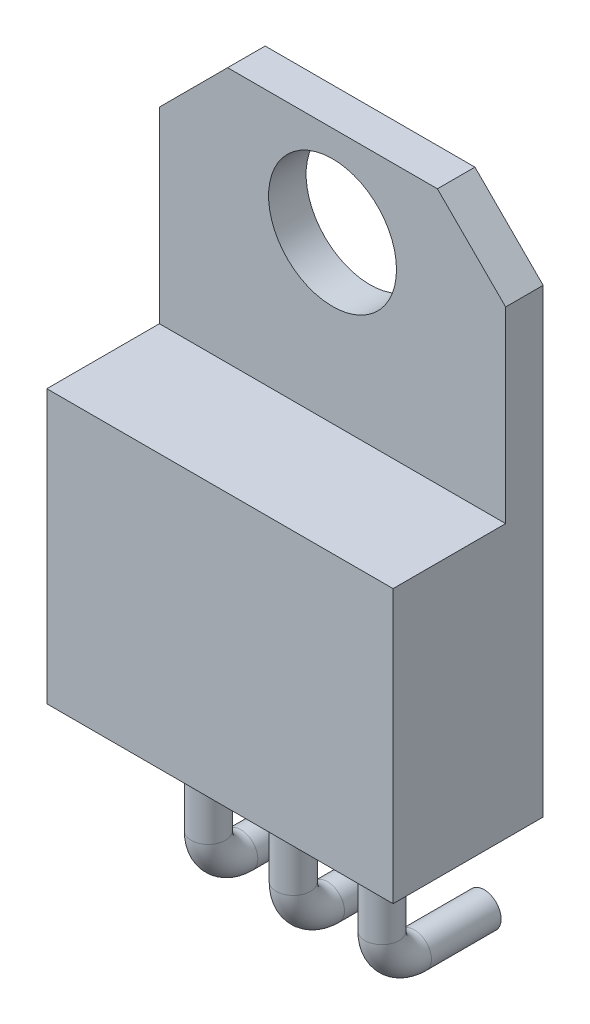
ISO-10303-21;
HEADER;
FILE_DESCRIPTION(('STEP AP214'),'2;1');
FILE_NAME('part.step','',(''),(''),'','','');
FILE_SCHEMA(('AUTOMOTIVE_DESIGN { 1 0 10303 214 1 1 1 1 }'));
ENDSEC;
DATA;
#1=APPLICATION_CONTEXT('core data for automotive mechanical design processes');
#2=APPLICATION_PROTOCOL_DEFINITION('international standard','automotive_design',2000,#1);
#3=PRODUCT_CONTEXT('',#1,'mechanical');
#4=PRODUCT('Part','Part','',(#3));
#5=PRODUCT_RELATED_PRODUCT_CATEGORY('part','',(#4));
#6=PRODUCT_DEFINITION_FORMATION('','',#4);
#7=PRODUCT_DEFINITION_CONTEXT('part definition',#1,'design');
#8=PRODUCT_DEFINITION('design','',#6,#7);
#9=PRODUCT_DEFINITION_SHAPE('','',#8);
#10=(LENGTH_UNIT() NAMED_UNIT(*) SI_UNIT(.MILLI.,.METRE.));
#11=(NAMED_UNIT(*) PLANE_ANGLE_UNIT() SI_UNIT($,.RADIAN.));
#12=(NAMED_UNIT(*) SI_UNIT($,.STERADIAN.) SOLID_ANGLE_UNIT());
#13=UNCERTAINTY_MEASURE_WITH_UNIT(LENGTH_MEASURE(1.E-05),#10,'distance_accuracy_value','');
#14=(GEOMETRIC_REPRESENTATION_CONTEXT(3) GLOBAL_UNCERTAINTY_ASSIGNED_CONTEXT((#13)) GLOBAL_UNIT_ASSIGNED_CONTEXT((#10,
#11,#12)) REPRESENTATION_CONTEXT('',''));
#15=CARTESIAN_POINT('',(0.,0.,0.));
#16=DIRECTION('',(0.,0.,1.));
#17=DIRECTION('',(1.,0.,0.));
#18=AXIS2_PLACEMENT_3D('',#15,#16,#17);
#19=CARTESIAN_POINT('',(0.,0.,1.1));
#20=DIRECTION('',(0.,1.,0.));
#21=DIRECTION('',(0.,0.,1.));
#22=AXIS2_PLACEMENT_3D('',#19,#20,#21);
#23=PLANE('',#22);
#24=CARTESIAN_POINT('',(7.625,0.,2.2));
#25=DIRECTION('',(0.,1.,0.));
#26=DIRECTION('',(0.,0.,-1.));
#27=AXIS2_PLACEMENT_3D('',#24,#25,#26);
#28=CIRCLE('',#27,0.5);
#29=CARTESIAN_POINT('',(7.625,0.,1.7));
#30=VERTEX_POINT('',#29);
#31=EDGE_CURVE('E466',#30,#30,#28,.T.);
#32=ORIENTED_EDGE('',*,*,#31,.T.);
#33=EDGE_LOOP('',(#32));
#34=FACE_BOUND('',#33,.T.);
#35=CARTESIAN_POINT('',(2.535,0.,2.2));
#36=DIRECTION('',(0.,1.,0.));
#37=DIRECTION('',(0.,0.,1.));
#38=AXIS2_PLACEMENT_3D('',#35,#36,#37);
#39=CIRCLE('',#38,0.5);
#40=CARTESIAN_POINT('',(2.535,0.,2.7));
#41=VERTEX_POINT('',#40);
#42=EDGE_CURVE('E36',#41,#41,#39,.F.);
#43=ORIENTED_EDGE('',*,*,#42,.F.);
#44=EDGE_LOOP('',(#43));
#45=FACE_BOUND('',#44,.T.);
#46=DIRECTION('',(1.,0.,0.));
#47=VECTOR('',#46,1.);
#48=CARTESIAN_POINT('',(0.,0.,0.));
#49=LINE('',#48,#47);
#50=CARTESIAN_POINT('',(0.,0.,0.));
#51=VERTEX_POINT('',#50);
#52=CARTESIAN_POINT('',(10.15,0.,0.));
#53=VERTEX_POINT('',#52);
#54=EDGE_CURVE('E186',#51,#53,#49,.T.);
#55=ORIENTED_EDGE('',*,*,#54,.T.);
#56=DIRECTION('',(0.,0.,-1.));
#57=VECTOR('',#56,1.);
#58=CARTESIAN_POINT('',(10.15,0.,1.1));
#59=LINE('',#58,#57);
#60=CARTESIAN_POINT('',(10.15,0.,4.4));
#61=VERTEX_POINT('',#60);
#62=EDGE_CURVE('E110',#61,#53,#59,.T.);
#63=ORIENTED_EDGE('',*,*,#62,.F.);
#64=DIRECTION('',(1.,0.,0.));
#65=VECTOR('',#64,1.);
#66=CARTESIAN_POINT('',(0.,0.,4.4));
#67=LINE('',#66,#65);
#68=CARTESIAN_POINT('',(0.,0.,4.4));
#69=VERTEX_POINT('',#68);
#70=EDGE_CURVE('E113',#69,#61,#67,.T.);
#71=ORIENTED_EDGE('',*,*,#70,.F.);
#72=DIRECTION('',(0.,0.,-1.));
#73=VECTOR('',#72,1.);
#74=CARTESIAN_POINT('',(0.,0.,1.1));
#75=LINE('',#74,#73);
#76=EDGE_CURVE('E98',#69,#51,#75,.T.);
#77=ORIENTED_EDGE('',*,*,#76,.T.);
#78=EDGE_LOOP('',(#55,#63,#71,#77));
#79=FACE_BOUND('',#78,.T.);
#80=CARTESIAN_POINT('',(5.07499999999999,0.,2.25));
#81=DIRECTION('',(0.,-1.,0.));
#82=DIRECTION('',(0.,0.,-1.));
#83=AXIS2_PLACEMENT_3D('',#80,#81,#82);
#84=CIRCLE('',#83,0.500000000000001);
#85=CARTESIAN_POINT('',(5.07499999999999,0.,1.75));
#86=VERTEX_POINT('',#85);
#87=EDGE_CURVE('E11',#86,#86,#84,.T.);
#88=ORIENTED_EDGE('',*,*,#87,.F.);
#89=EDGE_LOOP('',(#88));
#90=FACE_BOUND('',#89,.T.);
#91=ADVANCED_FACE('F32',(#34,#45,#79,#90),#23,.F.);
#92=CARTESIAN_POINT('',(0.,15.5,1.1));
#93=DIRECTION('',(0.,0.,-1.));
#94=DIRECTION('',(-1.,0.,0.));
#95=AXIS2_PLACEMENT_3D('',#92,#93,#94);
#96=PLANE('',#95);
#97=CARTESIAN_POINT('',(5.075,12.85,1.1));
#98=DIRECTION('',(0.,0.,1.));
#99=DIRECTION('',(1.,0.,0.));
#100=AXIS2_PLACEMENT_3D('',#97,#98,#99);
#101=CIRCLE('',#100,1.875);
#102=CARTESIAN_POINT('',(6.94999999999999,12.85,1.1));
#103=VERTEX_POINT('',#102);
#104=EDGE_CURVE('E147',#103,#103,#101,.T.);
#105=ORIENTED_EDGE('',*,*,#104,.F.);
#106=EDGE_LOOP('',(#105));
#107=FACE_BOUND('',#106,.T.);
#108=DIRECTION('',(-1.,0.,0.));
#109=VECTOR('',#108,1.);
#110=CARTESIAN_POINT('',(0.,8.,1.1));
#111=LINE('',#110,#109);
#112=CARTESIAN_POINT('',(10.15,8.,1.1));
#113=VERTEX_POINT('',#112);
#114=CARTESIAN_POINT('',(0.,8.,1.1));
#115=VERTEX_POINT('',#114);
#116=EDGE_CURVE('E48',#113,#115,#111,.T.);
#117=ORIENTED_EDGE('',*,*,#116,.F.);
#118=DIRECTION('',(0.,1.,0.));
#119=VECTOR('',#118,1.);
#120=CARTESIAN_POINT('',(10.15,0.,1.1));
#121=LINE('',#120,#119);
#122=CARTESIAN_POINT('',(10.15,13.5,1.1));
#123=VERTEX_POINT('',#122);
#124=EDGE_CURVE('E161',#113,#123,#121,.T.);
#125=ORIENTED_EDGE('',*,*,#124,.T.);
#126=DIRECTION('',(0.707106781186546,-0.707106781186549,0.));
#127=VECTOR('',#126,1.);
#128=CARTESIAN_POINT('',(8.15,15.5,1.1));
#129=LINE('',#128,#127);
#130=CARTESIAN_POINT('',(8.14999999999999,15.5,1.1));
#131=VERTEX_POINT('',#130);
#132=EDGE_CURVE('E165',#123,#131,#129,.F.);
#133=ORIENTED_EDGE('',*,*,#132,.T.);
#134=DIRECTION('',(-1.,0.,0.));
#135=VECTOR('',#134,1.);
#136=CARTESIAN_POINT('',(0.,15.5,1.1));
#137=LINE('',#136,#135);
#138=CARTESIAN_POINT('',(2.,15.5,1.1));
#139=VERTEX_POINT('',#138);
#140=EDGE_CURVE('E159',#131,#139,#137,.T.);
#141=ORIENTED_EDGE('',*,*,#140,.T.);
#142=DIRECTION('',(0.707106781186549,0.707106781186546,0.));
#143=VECTOR('',#142,1.);
#144=CARTESIAN_POINT('',(0.,13.5,1.1));
#145=LINE('',#144,#143);
#146=CARTESIAN_POINT('',(0.,13.5,1.1));
#147=VERTEX_POINT('',#146);
#148=EDGE_CURVE('E54',#139,#147,#145,.F.);
#149=ORIENTED_EDGE('',*,*,#148,.T.);
#150=DIRECTION('',(0.,-1.,0.));
#151=VECTOR('',#150,1.);
#152=CARTESIAN_POINT('',(0.,0.,1.1));
#153=LINE('',#152,#151);
#154=EDGE_CURVE('E139',#147,#115,#153,.T.);
#155=ORIENTED_EDGE('',*,*,#154,.T.);
#156=EDGE_LOOP('',(#117,#125,#133,#141,#149,#155));
#157=FACE_BOUND('',#156,.T.);
#158=ADVANCED_FACE('F202',(#107,#157),#96,.F.);
#159=CARTESIAN_POINT('',(0.,0.,1.1));
#160=DIRECTION('',(1.,0.,0.));
#161=DIRECTION('',(0.,1.,0.));
#162=AXIS2_PLACEMENT_3D('',#159,#160,#161);
#163=PLANE('',#162);
#164=ORIENTED_EDGE('',*,*,#154,.F.);
#165=DIRECTION('',(0.,0.,-1.));
#166=VECTOR('',#165,1.);
#167=CARTESIAN_POINT('',(0.,13.5,1.1));
#168=LINE('',#167,#166);
#169=CARTESIAN_POINT('',(0.,13.5,0.));
#170=VERTEX_POINT('',#169);
#171=EDGE_CURVE('E163',#147,#170,#168,.T.);
#172=ORIENTED_EDGE('',*,*,#171,.T.);
#173=DIRECTION('',(0.,-1.,0.));
#174=VECTOR('',#173,1.);
#175=CARTESIAN_POINT('',(0.,0.,0.));
#176=LINE('',#175,#174);
#177=EDGE_CURVE('E106',#170,#51,#176,.T.);
#178=ORIENTED_EDGE('',*,*,#177,.T.);
#179=ORIENTED_EDGE('',*,*,#76,.F.);
#180=DIRECTION('',(0.,-1.,0.));
#181=VECTOR('',#180,1.);
#182=CARTESIAN_POINT('',(0.,0.,4.4));
#183=LINE('',#182,#181);
#184=CARTESIAN_POINT('',(0.,8.,4.4));
#185=VERTEX_POINT('',#184);
#186=EDGE_CURVE('E103',#185,#69,#183,.T.);
#187=ORIENTED_EDGE('',*,*,#186,.F.);
#188=DIRECTION('',(0.,0.,-1.));
#189=VECTOR('',#188,1.);
#190=CARTESIAN_POINT('',(0.,8.,4.4));
#191=LINE('',#190,#189);
#192=EDGE_CURVE('E132',#185,#115,#191,.T.);
#193=ORIENTED_EDGE('',*,*,#192,.T.);
#194=EDGE_LOOP('',(#164,#172,#178,#179,#187,#193));
#195=FACE_BOUND('',#194,.T.);
#196=ADVANCED_FACE('F100',(#195),#163,.F.);
#197=CARTESIAN_POINT('',(10.15,0.,1.1));
#198=DIRECTION('',(-1.,0.,0.));
#199=DIRECTION('',(0.,-1.,0.));
#200=AXIS2_PLACEMENT_3D('',#197,#198,#199);
#201=PLANE('',#200);
#202=DIRECTION('',(0.,1.,0.));
#203=VECTOR('',#202,1.);
#204=CARTESIAN_POINT('',(10.15,0.,0.));
#205=LINE('',#204,#203);
#206=CARTESIAN_POINT('',(10.15,13.5,0.));
#207=VERTEX_POINT('',#206);
#208=EDGE_CURVE('E183',#53,#207,#205,.T.);
#209=ORIENTED_EDGE('',*,*,#208,.T.);
#210=DIRECTION('',(0.,0.,1.));
#211=VECTOR('',#210,1.);
#212=CARTESIAN_POINT('',(10.15,13.5,1.1));
#213=LINE('',#212,#211);
#214=EDGE_CURVE('E168',#207,#123,#213,.T.);
#215=ORIENTED_EDGE('',*,*,#214,.T.);
#216=ORIENTED_EDGE('',*,*,#124,.F.);
#217=DIRECTION('',(0.,0.,-1.));
#218=VECTOR('',#217,1.);
#219=CARTESIAN_POINT('',(10.15,8.,4.4));
#220=LINE('',#219,#218);
#221=CARTESIAN_POINT('',(10.15,8.,4.4));
#222=VERTEX_POINT('',#221);
#223=EDGE_CURVE('E143',#222,#113,#220,.T.);
#224=ORIENTED_EDGE('',*,*,#223,.F.);
#225=DIRECTION('',(0.,1.,0.));
#226=VECTOR('',#225,1.);
#227=CARTESIAN_POINT('',(10.15,0.,4.4));
#228=LINE('',#227,#226);
#229=EDGE_CURVE('E118',#61,#222,#228,.T.);
#230=ORIENTED_EDGE('',*,*,#229,.F.);
#231=ORIENTED_EDGE('',*,*,#62,.T.);
#232=EDGE_LOOP('',(#209,#215,#216,#224,#230,#231));
#233=FACE_BOUND('',#232,.T.);
#234=ADVANCED_FACE('F190',(#233),#201,.F.);
#235=CARTESIAN_POINT('',(0.,15.5,1.1));
#236=DIRECTION('',(0.,-1.,0.));
#237=DIRECTION('',(0.,0.,-1.));
#238=AXIS2_PLACEMENT_3D('',#235,#236,#237);
#239=PLANE('',#238);
#240=ORIENTED_EDGE('',*,*,#140,.F.);
#241=DIRECTION('',(0.,0.,-1.));
#242=VECTOR('',#241,1.);
#243=CARTESIAN_POINT('',(8.15,15.5,1.1));
#244=LINE('',#243,#242);
#245=CARTESIAN_POINT('',(8.15,15.5,0.));
#246=VERTEX_POINT('',#245);
#247=EDGE_CURVE('E175',#131,#246,#244,.T.);
#248=ORIENTED_EDGE('',*,*,#247,.T.);
#249=DIRECTION('',(-1.,0.,0.));
#250=VECTOR('',#249,1.);
#251=CARTESIAN_POINT('',(0.,15.5,0.));
#252=LINE('',#251,#250);
#253=CARTESIAN_POINT('',(2.,15.5,0.));
#254=VERTEX_POINT('',#253);
#255=EDGE_CURVE('E180',#246,#254,#252,.T.);
#256=ORIENTED_EDGE('',*,*,#255,.T.);
#257=DIRECTION('',(0.,0.,1.));
#258=VECTOR('',#257,1.);
#259=CARTESIAN_POINT('',(2.,15.5,1.1));
#260=LINE('',#259,#258);
#261=EDGE_CURVE('E109',#254,#139,#260,.T.);
#262=ORIENTED_EDGE('',*,*,#261,.T.);
#263=EDGE_LOOP('',(#240,#248,#256,#262));
#264=FACE_BOUND('',#263,.T.);
#265=ADVANCED_FACE('F200',(#264),#239,.F.);
#266=CARTESIAN_POINT('',(0.,15.5,0.));
#267=DIRECTION('',(0.,0.,-1.));
#268=DIRECTION('',(-1.,0.,0.));
#269=AXIS2_PLACEMENT_3D('',#266,#267,#268);
#270=PLANE('',#269);
#271=CARTESIAN_POINT('',(5.075,12.85,0.));
#272=DIRECTION('',(0.,0.,1.));
#273=DIRECTION('',(1.,0.,0.));
#274=AXIS2_PLACEMENT_3D('',#271,#272,#273);
#275=CIRCLE('',#274,1.875);
#276=CARTESIAN_POINT('',(6.94999999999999,12.85,0.));
#277=VERTEX_POINT('',#276);
#278=EDGE_CURVE('E135',#277,#277,#275,.T.);
#279=ORIENTED_EDGE('',*,*,#278,.T.);
#280=EDGE_LOOP('',(#279));
#281=FACE_BOUND('',#280,.T.);
#282=ORIENTED_EDGE('',*,*,#255,.F.);
#283=DIRECTION('',(-0.707106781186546,0.707106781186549,0.));
#284=VECTOR('',#283,1.);
#285=CARTESIAN_POINT('',(4.07500000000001,19.575,0.));
#286=LINE('',#285,#284);
#287=EDGE_CURVE('E171',#246,#207,#286,.F.);
#288=ORIENTED_EDGE('',*,*,#287,.T.);
#289=ORIENTED_EDGE('',*,*,#208,.F.);
#290=ORIENTED_EDGE('',*,*,#54,.F.);
#291=ORIENTED_EDGE('',*,*,#177,.F.);
#292=DIRECTION('',(-0.707106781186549,-0.707106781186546,0.));
#293=VECTOR('',#292,1.);
#294=CARTESIAN_POINT('',(0.999999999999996,14.5,0.));
#295=LINE('',#294,#293);
#296=EDGE_CURVE('E173',#170,#254,#295,.F.);
#297=ORIENTED_EDGE('',*,*,#296,.T.);
#298=EDGE_LOOP('',(#282,#288,#289,#290,#291,#297));
#299=FACE_BOUND('',#298,.T.);
#300=ADVANCED_FACE('F193',(#281,#299),#270,.T.);
#301=CARTESIAN_POINT('',(5.075,12.85,0.));
#302=DIRECTION('',(0.,0.,1.));
#303=DIRECTION('',(1.,0.,0.));
#304=AXIS2_PLACEMENT_3D('',#301,#302,#303);
#305=CYLINDRICAL_SURFACE('',#304,1.875);
#306=ORIENTED_EDGE('',*,*,#278,.F.);
#307=EDGE_LOOP('',(#306));
#308=FACE_BOUND('',#307,.T.);
#309=ORIENTED_EDGE('',*,*,#104,.T.);
#310=EDGE_LOOP('',(#309));
#311=FACE_BOUND('',#310,.T.);
#312=ADVANCED_FACE('F230',(#308,#311),#305,.F.);
#313=CARTESIAN_POINT('',(8.15,15.5,1.1));
#314=DIRECTION('',(-0.707106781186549,-0.707106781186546,0.));
#315=DIRECTION('',(0.707106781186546,-0.707106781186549,0.));
#316=AXIS2_PLACEMENT_3D('',#313,#314,#315);
#317=PLANE('',#316);
#318=ORIENTED_EDGE('',*,*,#132,.F.);
#319=ORIENTED_EDGE('',*,*,#214,.F.);
#320=ORIENTED_EDGE('',*,*,#287,.F.);
#321=ORIENTED_EDGE('',*,*,#247,.F.);
#322=EDGE_LOOP('',(#318,#319,#320,#321));
#323=FACE_BOUND('',#322,.T.);
#324=ADVANCED_FACE('F197',(#323),#317,.F.);
#325=CARTESIAN_POINT('',(0.,13.5,1.1));
#326=DIRECTION('',(0.707106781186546,-0.707106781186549,0.));
#327=DIRECTION('',(0.707106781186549,0.707106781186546,0.));
#328=AXIS2_PLACEMENT_3D('',#325,#326,#327);
#329=PLANE('',#328);
#330=ORIENTED_EDGE('',*,*,#148,.F.);
#331=ORIENTED_EDGE('',*,*,#261,.F.);
#332=ORIENTED_EDGE('',*,*,#296,.F.);
#333=ORIENTED_EDGE('',*,*,#171,.F.);
#334=EDGE_LOOP('',(#330,#331,#332,#333));
#335=FACE_BOUND('',#334,.T.);
#336=ADVANCED_FACE('F34',(#335),#329,.F.);
#337=CARTESIAN_POINT('',(0.,8.,4.4));
#338=DIRECTION('',(0.,-1.,0.));
#339=DIRECTION('',(0.,0.,-1.));
#340=AXIS2_PLACEMENT_3D('',#337,#338,#339);
#341=PLANE('',#340);
#342=ORIENTED_EDGE('',*,*,#116,.T.);
#343=ORIENTED_EDGE('',*,*,#192,.F.);
#344=DIRECTION('',(-1.,0.,0.));
#345=VECTOR('',#344,1.);
#346=CARTESIAN_POINT('',(0.,8.,4.4));
#347=LINE('',#346,#345);
#348=EDGE_CURVE('E122',#222,#185,#347,.T.);
#349=ORIENTED_EDGE('',*,*,#348,.F.);
#350=ORIENTED_EDGE('',*,*,#223,.T.);
#351=EDGE_LOOP('',(#342,#343,#349,#350));
#352=FACE_BOUND('',#351,.T.);
#353=ADVANCED_FACE('F205',(#352),#341,.F.);
#354=CARTESIAN_POINT('',(0.,8.,4.4));
#355=DIRECTION('',(0.,0.,-1.));
#356=DIRECTION('',(-1.,0.,0.));
#357=AXIS2_PLACEMENT_3D('',#354,#355,#356);
#358=PLANE('',#357);
#359=ORIENTED_EDGE('',*,*,#186,.T.);
#360=ORIENTED_EDGE('',*,*,#70,.T.);
#361=ORIENTED_EDGE('',*,*,#229,.T.);
#362=ORIENTED_EDGE('',*,*,#348,.T.);
#363=EDGE_LOOP('',(#359,#360,#361,#362));
#364=FACE_BOUND('',#363,.T.);
#365=ADVANCED_FACE('F120',(#364),#358,.F.);
#366=CARTESIAN_POINT('',(2.535,-4.,1.24999999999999));
#367=DIRECTION('',(0.,0.,-1.));
#368=DIRECTION('',(-1.,0.,0.));
#369=AXIS2_PLACEMENT_3D('',#366,#367,#368);
#370=CYLINDRICAL_SURFACE('',#369,0.5);
#371=CARTESIAN_POINT('',(2.535,-4.,1.24999999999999));
#372=DIRECTION('',(0.,0.,-1.));
#373=DIRECTION('',(0.,1.,0.));
#374=AXIS2_PLACEMENT_3D('',#371,#372,#373);
#375=CIRCLE('',#374,0.5);
#376=CARTESIAN_POINT('',(2.535,-4.5,1.24999999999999));
#377=VERTEX_POINT('',#376);
#378=EDGE_CURVE('E451',#377,#377,#375,.T.);
#379=ORIENTED_EDGE('',*,*,#378,.T.);
#380=EDGE_LOOP('',(#379));
#381=FACE_BOUND('',#380,.T.);
#382=CARTESIAN_POINT('',(2.535,-4.,-0.791981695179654));
#383=DIRECTION('',(0.,0.,-1.));
#384=DIRECTION('',(0.,1.,0.));
#385=AXIS2_PLACEMENT_3D('',#382,#383,#384);
#386=CIRCLE('',#385,0.5);
#387=CARTESIAN_POINT('',(2.535,-3.5,-0.791981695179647));
#388=VERTEX_POINT('',#387);
#389=EDGE_CURVE('E125',#388,#388,#386,.T.);
#390=ORIENTED_EDGE('',*,*,#389,.F.);
#391=EDGE_LOOP('',(#390));
#392=FACE_BOUND('',#391,.T.);
#393=ADVANCED_FACE('F212',(#381,#392),#370,.T.);
#394=CARTESIAN_POINT('',(2.535,-3.05,1.25));
#395=DIRECTION('',(1.,0.,0.));
#396=DIRECTION('',(0.,0.,-1.));
#397=AXIS2_PLACEMENT_3D('',#394,#395,#396);
#398=TOROIDAL_SURFACE('',#397,0.950000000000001,0.5);
#399=CARTESIAN_POINT('',(2.535,-3.04999999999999,2.2));
#400=DIRECTION('',(0.,-1.,0.));
#401=DIRECTION('',(0.,0.,-1.));
#402=AXIS2_PLACEMENT_3D('',#399,#400,#401);
#403=CIRCLE('',#402,0.5);
#404=CARTESIAN_POINT('',(2.535,-3.04999999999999,2.7));
#405=VERTEX_POINT('',#404);
#406=EDGE_CURVE('E449',#405,#405,#403,.T.);
#407=CARTESIAN_POINT('',(2.535,-3.05,1.25));
#408=DIRECTION('',(1.,0.,0.));
#409=DIRECTION('',(0.,0.,-1.));
#410=AXIS2_PLACEMENT_3D('',#407,#408,#409);
#411=CIRCLE('',#410,1.45);
#412=EDGE_CURVE('',#405,#377,#411,.T.);
#413=ORIENTED_EDGE('',*,*,#406,.T.);
#414=ORIENTED_EDGE('',*,*,#378,.F.);
#415=ORIENTED_EDGE('',*,*,#412,.T.);
#416=ORIENTED_EDGE('',*,*,#412,.F.);
#417=EDGE_LOOP('',(#413,#415,#414,#416));
#418=FACE_BOUND('',#417,.T.);
#419=ADVANCED_FACE('F308',(#418),#398,.T.);
#420=CARTESIAN_POINT('',(2.535,-3.04999999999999,2.2));
#421=DIRECTION('',(0.,1.,0.));
#422=DIRECTION('',(0.,0.,1.));
#423=AXIS2_PLACEMENT_3D('',#420,#421,#422);
#424=CYLINDRICAL_SURFACE('',#423,0.5);
#425=ORIENTED_EDGE('',*,*,#406,.F.);
#426=EDGE_LOOP('',(#425));
#427=FACE_BOUND('',#426,.T.);
#428=ORIENTED_EDGE('',*,*,#42,.T.);
#429=EDGE_LOOP('',(#428));
#430=FACE_BOUND('',#429,.T.);
#431=ADVANCED_FACE('F317',(#427,#430),#424,.T.);
#432=CARTESIAN_POINT('',(2.535,-4.,-0.791981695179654));
#433=DIRECTION('',(0.,0.,-1.));
#434=DIRECTION('',(0.,1.,0.));
#435=AXIS2_PLACEMENT_3D('',#432,#433,#434);
#436=PLANE('',#435);
#437=ORIENTED_EDGE('',*,*,#389,.T.);
#438=EDGE_LOOP('',(#437));
#439=FACE_BOUND('',#438,.T.);
#440=ADVANCED_FACE('F326',(#439),#436,.T.);
#441=CARTESIAN_POINT('',(5.07499999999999,-4.05,1.24999999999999));
#442=DIRECTION('',(0.,0.,-1.));
#443=DIRECTION('',(-1.,0.,0.));
#444=AXIS2_PLACEMENT_3D('',#441,#442,#443);
#445=CYLINDRICAL_SURFACE('',#444,0.500000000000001);
#446=CARTESIAN_POINT('',(5.07499999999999,-4.05,1.24999999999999));
#447=DIRECTION('',(0.,0.,-1.));
#448=DIRECTION('',(0.,1.,0.));
#449=AXIS2_PLACEMENT_3D('',#446,#447,#448);
#450=CIRCLE('',#449,0.500000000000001);
#451=CARTESIAN_POINT('',(5.07499999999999,-4.55,1.24999999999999));
#452=VERTEX_POINT('',#451);
#453=EDGE_CURVE('E437',#452,#452,#450,.T.);
#454=ORIENTED_EDGE('',*,*,#453,.T.);
#455=EDGE_LOOP('',(#454));
#456=FACE_BOUND('',#455,.T.);
#457=CARTESIAN_POINT('',(5.07499999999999,-4.05,-0.791981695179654));
#458=DIRECTION('',(0.,0.,-1.));
#459=DIRECTION('',(0.,1.,0.));
#460=AXIS2_PLACEMENT_3D('',#457,#458,#459);
#461=CIRCLE('',#460,0.500000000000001);
#462=CARTESIAN_POINT('',(5.07499999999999,-3.55,-0.791981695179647));
#463=VERTEX_POINT('',#462);
#464=EDGE_CURVE('E446',#463,#463,#461,.T.);
#465=ORIENTED_EDGE('',*,*,#464,.F.);
#466=EDGE_LOOP('',(#465));
#467=FACE_BOUND('',#466,.T.);
#468=ADVANCED_FACE('F335',(#456,#467),#445,.T.);
#469=CARTESIAN_POINT('',(5.07499999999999,-3.05,1.25));
#470=DIRECTION('',(1.,0.,0.));
#471=DIRECTION('',(0.,0.,-1.));
#472=AXIS2_PLACEMENT_3D('',#469,#470,#471);
#473=TOROIDAL_SURFACE('',#472,1.,0.500000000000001);
#474=CARTESIAN_POINT('',(5.07499999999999,-3.04999999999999,2.25));
#475=DIRECTION('',(0.,-1.,0.));
#476=DIRECTION('',(0.,0.,-1.));
#477=AXIS2_PLACEMENT_3D('',#474,#475,#476);
#478=CIRCLE('',#477,0.500000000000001);
#479=CARTESIAN_POINT('',(5.07499999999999,-3.04999999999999,2.75));
#480=VERTEX_POINT('',#479);
#481=EDGE_CURVE('E433',#480,#480,#478,.T.);
#482=CARTESIAN_POINT('',(5.07499999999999,-3.05,1.25));
#483=DIRECTION('',(1.,0.,0.));
#484=DIRECTION('',(0.,0.,-1.));
#485=AXIS2_PLACEMENT_3D('',#482,#483,#484);
#486=CIRCLE('',#485,1.5);
#487=EDGE_CURVE('',#480,#452,#486,.T.);
#488=ORIENTED_EDGE('',*,*,#481,.T.);
#489=ORIENTED_EDGE('',*,*,#453,.F.);
#490=ORIENTED_EDGE('',*,*,#487,.T.);
#491=ORIENTED_EDGE('',*,*,#487,.F.);
#492=EDGE_LOOP('',(#488,#490,#489,#491));
#493=FACE_BOUND('',#492,.T.);
#494=ADVANCED_FACE('F353',(#493),#473,.T.);
#495=CARTESIAN_POINT('',(5.07499999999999,-3.04999999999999,2.25));
#496=DIRECTION('',(0.,1.,0.));
#497=DIRECTION('',(0.,0.,1.));
#498=AXIS2_PLACEMENT_3D('',#495,#496,#497);
#499=CYLINDRICAL_SURFACE('',#498,0.500000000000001);
#500=ORIENTED_EDGE('',*,*,#481,.F.);
#501=EDGE_LOOP('',(#500));
#502=FACE_BOUND('',#501,.T.);
#503=ORIENTED_EDGE('',*,*,#87,.T.);
#504=EDGE_LOOP('',(#503));
#505=FACE_BOUND('',#504,.T.);
#506=ADVANCED_FACE('F362',(#502,#505),#499,.T.);
#507=CARTESIAN_POINT('',(5.07499999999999,-4.05,-0.791981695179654));
#508=DIRECTION('',(0.,0.,-1.));
#509=DIRECTION('',(0.,1.,0.));
#510=AXIS2_PLACEMENT_3D('',#507,#508,#509);
#511=PLANE('',#510);
#512=ORIENTED_EDGE('',*,*,#464,.T.);
#513=EDGE_LOOP('',(#512));
#514=FACE_BOUND('',#513,.T.);
#515=ADVANCED_FACE('F371',(#514),#511,.T.);
#516=CARTESIAN_POINT('',(7.625,-4.,1.24999999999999));
#517=DIRECTION('',(0.,0.,-1.));
#518=DIRECTION('',(-1.,0.,0.));
#519=AXIS2_PLACEMENT_3D('',#516,#517,#518);
#520=CYLINDRICAL_SURFACE('',#519,0.5);
#521=CARTESIAN_POINT('',(7.625,-4.,1.24999999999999));
#522=DIRECTION('',(0.,0.,1.));
#523=DIRECTION('',(0.,1.,0.));
#524=AXIS2_PLACEMENT_3D('',#521,#522,#523);
#525=CIRCLE('',#524,0.5);
#526=CARTESIAN_POINT('',(7.625,-4.5,1.24999999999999));
#527=VERTEX_POINT('',#526);
#528=EDGE_CURVE('E434',#527,#527,#525,.T.);
#529=ORIENTED_EDGE('',*,*,#528,.F.);
#530=EDGE_LOOP('',(#529));
#531=FACE_BOUND('',#530,.T.);
#532=CARTESIAN_POINT('',(7.625,-4.,-0.791981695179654));
#533=DIRECTION('',(0.,0.,1.));
#534=DIRECTION('',(0.,1.,0.));
#535=AXIS2_PLACEMENT_3D('',#532,#533,#534);
#536=CIRCLE('',#535,0.5);
#537=CARTESIAN_POINT('',(7.625,-3.5,-0.791981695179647));
#538=VERTEX_POINT('',#537);
#539=EDGE_CURVE('E431',#538,#538,#536,.T.);
#540=ORIENTED_EDGE('',*,*,#539,.T.);
#541=EDGE_LOOP('',(#540));
#542=FACE_BOUND('',#541,.T.);
#543=ADVANCED_FACE('F379',(#531,#542),#520,.T.);
#544=CARTESIAN_POINT('',(7.625,-3.05,1.25));
#545=DIRECTION('',(1.,0.,0.));
#546=DIRECTION('',(0.,0.,-1.));
#547=AXIS2_PLACEMENT_3D('',#544,#545,#546);
#548=TOROIDAL_SURFACE('',#547,0.950000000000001,0.5);
#549=CARTESIAN_POINT('',(7.625,-3.04999999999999,2.2));
#550=DIRECTION('',(0.,1.,0.));
#551=DIRECTION('',(0.,0.,-1.));
#552=AXIS2_PLACEMENT_3D('',#549,#550,#551);
#553=CIRCLE('',#552,0.5);
#554=CARTESIAN_POINT('',(7.625,-3.04999999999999,2.7));
#555=VERTEX_POINT('',#554);
#556=EDGE_CURVE('E440',#555,#555,#553,.T.);
#557=CARTESIAN_POINT('',(7.625,-3.05,1.25));
#558=DIRECTION('',(1.,0.,0.));
#559=DIRECTION('',(0.,0.,-1.));
#560=AXIS2_PLACEMENT_3D('',#557,#558,#559);
#561=CIRCLE('',#560,1.45);
#562=EDGE_CURVE('',#555,#527,#561,.T.);
#563=ORIENTED_EDGE('',*,*,#556,.F.);
#564=ORIENTED_EDGE('',*,*,#528,.T.);
#565=ORIENTED_EDGE('',*,*,#562,.T.);
#566=ORIENTED_EDGE('',*,*,#562,.F.);
#567=EDGE_LOOP('',(#563,#565,#564,#566));
#568=FACE_BOUND('',#567,.T.);
#569=ADVANCED_FACE('F387',(#568),#548,.T.);
#570=CARTESIAN_POINT('',(7.625,-3.04999999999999,2.2));
#571=DIRECTION('',(0.,1.,0.));
#572=DIRECTION('',(0.,0.,1.));
#573=AXIS2_PLACEMENT_3D('',#570,#571,#572);
#574=CYLINDRICAL_SURFACE('',#573,0.5);
#575=ORIENTED_EDGE('',*,*,#556,.T.);
#576=EDGE_LOOP('',(#575));
#577=FACE_BOUND('',#576,.T.);
#578=ORIENTED_EDGE('',*,*,#31,.F.);
#579=EDGE_LOOP('',(#578));
#580=FACE_BOUND('',#579,.T.);
#581=ADVANCED_FACE('F396',(#577,#580),#574,.T.);
#582=CARTESIAN_POINT('',(7.625,-4.,-0.791981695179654));
#583=DIRECTION('',(0.,0.,-1.));
#584=DIRECTION('',(0.,1.,0.));
#585=AXIS2_PLACEMENT_3D('',#582,#583,#584);
#586=PLANE('',#585);
#587=ORIENTED_EDGE('',*,*,#539,.F.);
#588=EDGE_LOOP('',(#587));
#589=FACE_BOUND('',#588,.T.);
#590=ADVANCED_FACE('F405',(#589),#586,.T.);
#591=CLOSED_SHELL('',(#91,#158,#196,#234,#265,#300,#312,#324,#336,#353,#365,#393,#419,#431,#440,
#468,#494,#506,#515,#543,#569,#581,#590));
#592=MANIFOLD_SOLID_BREP('B2',#591);
#593=ADVANCED_BREP_SHAPE_REPRESENTATION('',(#18,#592),#14);
#594=SHAPE_DEFINITION_REPRESENTATION(#9,#593);
ENDSEC;
END-ISO-10303-21;
